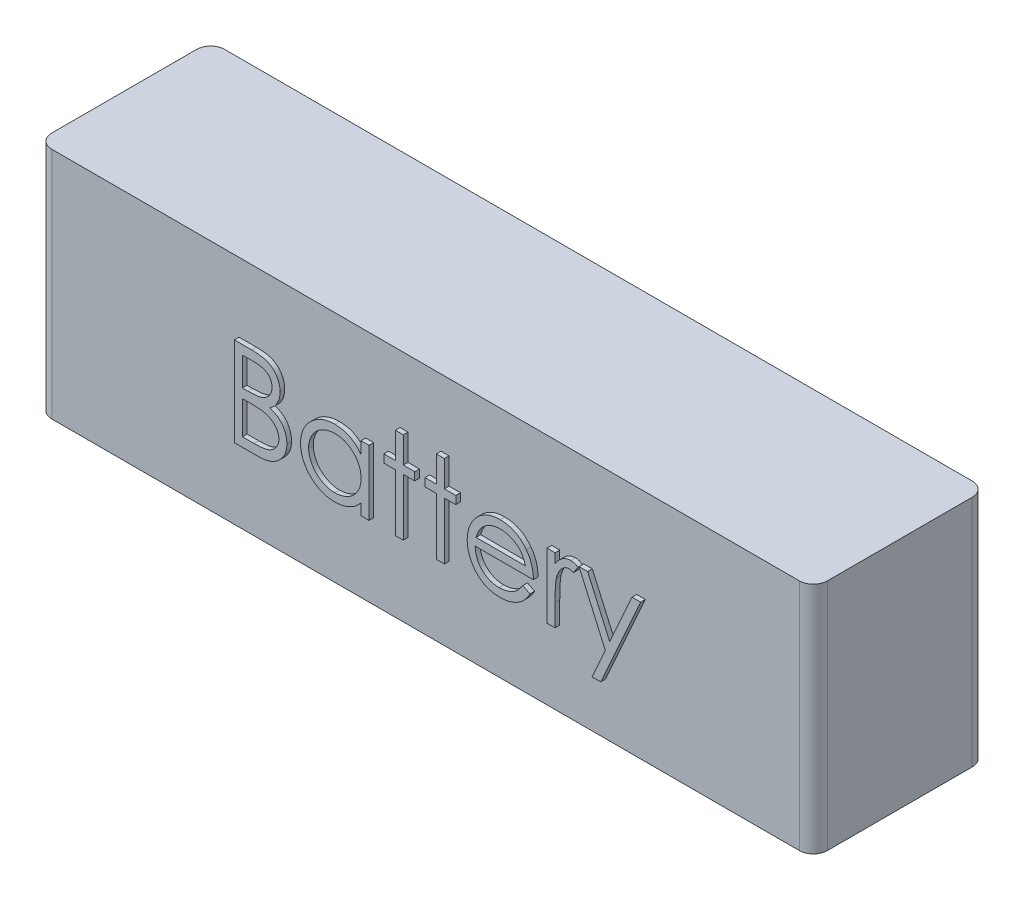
from build123d import *

# Parameters (mm, degrees)
SKETCH1_W           = 166
SKETCH1_H           = 37
BOSS_EXTRUDE1_DEPTH = 50
FILLET2_R           = 3
BOSS_EXTRUDE2_DEPTH = 1


with BuildPart() as part:
    # Sketch1 → Boss-Extrude1 (new body)
    with BuildSketch(Plane(origin=(0, 0, 0), x_dir=(1, 0, 0), z_dir=(0, 1, 0))):
        with Locations((83, 18.5)):
            Rectangle(SKETCH1_W, SKETCH1_H)
    extrude(amount=BOSS_EXTRUDE1_DEPTH)

    # Fillet2
    fillet2_edges = [part.edges().sort_by_distance(p)[0] for p in [
        (0, 25, -37),
        (166, 25, -37),
        (166, 25, 0),
        (0, 25, 0),
    ]]
    fillet(fillet2_edges, radius=FILLET2_R)

    # Sketch2 → Boss-Extrude2 (add)
    # profile 1 of 7: a face of its own
    with BuildSketch(Plane.XY):
        with BuildLine():
            Line((43.08714198, 35.197994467), (46.804028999, 35.197994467))
            add(Edge.make_bspline(
                [(46.804028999, 35.197994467), (46.98597543, 35.197037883), (47.338632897, 35.195183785), (47.851455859, 35.166428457), (48.331781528, 35.127219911), (48.779749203, 35.065007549), (49.195151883, 34.989940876), (49.579241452, 34.899035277), (49.930796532, 34.79003328), (50.35051014, 34.616698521), (50.829049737, 34.359125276), (51.347200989, 33.978514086), (51.790272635, 33.512973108), (52.172286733, 32.987831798), (52.476004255, 32.410149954), (52.695728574, 31.79369637), (52.834836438, 31.146422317), (52.84914263, 30.702050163), (52.856372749, 30.477471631)],
                knots=[0, 0, 0, 0, 1.001505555, 1.941167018, 2.826882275, 3.653841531, 4.429895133, 5.150066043, 5.825578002, 6.45369114, 7.647487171, 8.808567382, 9.977351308, 11.170798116, 12.373658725, 13.556498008, 14.765093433, 16, 16, 16, 16], degree=3))
            add(Edge.make_bspline(
                [(52.856372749, 30.477471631), (52.850422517, 30.267091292), (52.838729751, 29.853674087), (52.726918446, 29.24900472), (52.551872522, 28.673415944), (52.308548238, 28.129008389), (51.992307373, 27.62808258), (51.617521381, 27.166597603), (51.165346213, 26.764092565), (50.82656515, 26.539069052), (50.65447972, 26.424767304)],
                knots=[0, 0, 0, 0, 1.044552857, 2.05264487, 3.044412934, 4.028983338, 5.005914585, 5.980388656, 6.974128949, 8, 8, 8, 8], degree=3))
            add(Edge.make_bspline(
                [(50.65447972, 26.424767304), (50.870890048, 26.341682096), (51.284936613, 26.18271951), (51.854727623, 25.901675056), (52.345645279, 25.595992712), (52.761464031, 25.262172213), (53.117087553, 24.9023514), (53.427618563, 24.511254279), (53.692584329, 24.083779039), (53.919621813, 23.624382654), (54.096780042, 23.137756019), (54.229454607, 22.628463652), (54.305477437, 22.098331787), (54.316295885, 21.737549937), (54.321757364, 21.555416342)],
                knots=[0, 0, 0, 0, 1.27268992, 2.434971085, 3.483601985, 4.442670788, 5.356604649, 6.2567628, 7.179492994, 8.113709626, 9.066344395, 10.018646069, 10.999752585, 12, 12, 12, 12], degree=3))
            add(Edge.make_bspline(
                [(54.321757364, 21.555416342), (54.316440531, 21.369450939), (54.305979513, 21.003558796), (54.228799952, 20.466048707), (54.098121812, 19.952379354), (53.918120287, 19.459228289), (53.683193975, 18.987549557), (53.397291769, 18.536808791), (53.056397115, 18.111534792), (52.675054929, 17.707001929), (52.243642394, 17.343267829), (51.778192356, 17.01933234), (51.272843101, 16.752925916), (50.735894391, 16.529137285), (50.161322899, 16.35819239), (49.551708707, 16.23859881), (48.907577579, 16.158017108), (48.465564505, 16.151392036), (48.238884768, 16.147994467)],
                knots=[0, 0, 0, 0, 0.978564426, 1.925352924, 2.850884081, 3.763762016, 4.682927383, 5.618979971, 6.567305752, 7.547517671, 8.540179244, 9.531824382, 10.526200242, 11.540722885, 12.589160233, 13.674978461, 14.80764778, 16, 16, 16, 16], degree=3))
            Line((48.238884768, 16.147994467), (43.08714198, 16.147994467))
            Line((43.08714198, 16.147994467), (43.08714198, 35.197994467))
        make_face()
        with BuildLine():
            Line((44.796757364, 33.244148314), (44.796757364, 27.138379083))
            Line((44.796757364, 27.138379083), (45.945405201, 27.138379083))
            add(Edge.make_bspline(
                [(45.945405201, 27.138379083), (46.113310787, 27.140555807), (46.437738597, 27.144761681), (46.907565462, 27.156809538), (47.34367449, 27.190544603), (47.745312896, 27.224269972), (48.111848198, 27.279104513), (48.442468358, 27.344375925), (48.74236215, 27.413407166), (49.08819882, 27.530806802), (49.480481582, 27.704312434), (49.898673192, 27.97358057), (50.267342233, 28.294297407), (50.578658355, 28.664362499), (50.833446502, 29.071848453), (51.010414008, 29.510253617), (51.130414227, 29.968651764), (51.141253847, 30.283348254), (51.146757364, 30.443126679)],
                knots=[0, 0, 0, 0, 1.156816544, 2.235205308, 3.236616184, 4.169592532, 5.011045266, 5.787822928, 6.49130361, 7.128639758, 8.301311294, 9.436451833, 10.541879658, 11.654887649, 12.756523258, 13.837046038, 14.901820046, 16, 16, 16, 16], degree=3))
            add(Edge.make_bspline(
                [(51.146757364, 30.443126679), (51.143893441, 30.548858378), (51.138275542, 30.756262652), (51.092265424, 31.058609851), (51.014064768, 31.342965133), (50.913620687, 31.613225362), (50.773256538, 31.860939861), (50.607992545, 32.09467354), (50.408317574, 32.306466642), (50.181038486, 32.504420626), (49.91973441, 32.679922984), (49.624561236, 32.833633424), (49.291525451, 32.957408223), (48.926239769, 33.065808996), (48.523081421, 33.141945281), (48.086702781, 33.205373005), (47.613529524, 33.237664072), (47.286168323, 33.24193869), (47.116949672, 33.244148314)],
                knots=[0, 0, 0, 0, 0.91205012, 1.789085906, 2.630437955, 3.453916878, 4.269457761, 5.079663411, 5.91843418, 6.774407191, 7.675494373, 8.627863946, 9.638891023, 10.736472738, 11.911756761, 13.175263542, 14.539845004, 16, 16, 16, 16], degree=3))
            Line((47.116949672, 33.244148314), (44.796757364, 33.244148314))
        make_face(mode=Mode.SUBTRACT)
        with BuildLine():
            Line((44.796757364, 25.184532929), (44.796757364, 18.101840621))
            Line((44.796757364, 18.101840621), (47.231432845, 18.101840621))
            add(Edge.make_bspline(
                [(47.231432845, 18.101840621), (47.405707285, 18.103929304), (47.741598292, 18.107954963), (48.226563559, 18.121097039), (48.676051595, 18.150990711), (49.088011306, 18.198048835), (49.466891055, 18.249094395), (49.808145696, 18.317735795), (50.114541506, 18.396379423), (50.469820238, 18.517941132), (50.869889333, 18.706789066), (51.301022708, 18.991527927), (51.684342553, 19.330744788), (52.009854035, 19.72334305), (52.27662473, 20.150233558), (52.470692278, 20.60278182), (52.59038537, 21.07351019), (52.604875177, 21.394457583), (52.61214198, 21.555416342)],
                knots=[0, 0, 0, 0, 1.160039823, 2.235823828, 3.228722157, 4.157150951, 4.99529583, 5.772374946, 6.472645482, 7.099169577, 8.269452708, 9.405989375, 10.527446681, 11.663510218, 12.788923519, 13.866172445, 14.929861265, 16, 16, 16, 16], degree=3))
            add(Edge.make_bspline(
                [(52.61214198, 21.555416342), (52.610639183, 21.656072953), (52.607657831, 21.855762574), (52.562696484, 22.149218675), (52.497306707, 22.433476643), (52.412771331, 22.709308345), (52.289656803, 22.971726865), (52.145929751, 23.225922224), (51.977411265, 23.472230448), (51.714825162, 23.78362857), (51.332889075, 24.142405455), (50.79019934, 24.49367386), (50.173130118, 24.776962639), (49.725577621, 24.897246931), (49.494383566, 24.959382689)],
                knots=[0, 0, 0, 0, 0.723448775, 1.435228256, 2.130040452, 2.821711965, 3.505591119, 4.210454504, 4.921174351, 5.648778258, 7.137944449, 8.670945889, 10.280296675, 12, 12, 12, 12], degree=3))
            add(Edge.make_bspline(
                [(49.494383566, 24.959382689), (49.40169663, 24.978188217), (49.200732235, 25.018962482), (48.873030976, 25.062002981), (48.498911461, 25.100348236), (48.0775098, 25.128711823), (47.608292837, 25.15803001), (47.090258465, 25.169431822), (46.525522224, 25.183034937), (46.133678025, 25.184020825), (45.930140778, 25.184532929)],
                knots=[0, 0, 0, 0, 0.634451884, 1.375622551, 2.216452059, 3.157844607, 4.20941857, 5.370758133, 6.634282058, 8, 8, 8, 8], degree=3))
            Line((45.930140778, 25.184532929), (44.796757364, 25.184532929))
        make_face(mode=Mode.SUBTRACT)
    # profile 2 of 7: a face of its own
    with BuildSketch(Plane.XY):
        with BuildLine():
            Line((71.906372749, 30.069148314), (71.906372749, 16.147994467))
            Line((71.906372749, 16.147994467), (70.196757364, 16.147994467))
            Line((70.196757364, 16.147994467), (70.196757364, 18.555957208))
            add(Edge.make_bspline(
                [(70.196757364, 18.555957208), (70.003977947, 18.338027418), (69.627766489, 17.912734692), (68.999436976, 17.357116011), (68.333404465, 16.897856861), (67.63290156, 16.526926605), (66.898560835, 16.248295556), (66.132010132, 16.05025089), (65.332936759, 15.922921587), (64.787277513, 15.910206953), (64.510759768, 15.903763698)],
                knots=[0, 0, 0, 0, 1.074387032, 2.096679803, 3.090159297, 4.057316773, 5.018401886, 5.985159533, 6.978961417, 8, 8, 8, 8], degree=3))
            add(Edge.make_bspline(
                [(64.510759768, 15.903763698), (64.264917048, 15.910438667), (63.780104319, 15.923602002), (63.06693177, 16.02572254), (62.38062967, 16.189719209), (61.720549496, 16.417779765), (61.090962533, 16.720298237), (60.486478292, 17.082472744), (59.910228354, 17.513769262), (59.370996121, 18.006826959), (58.874433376, 18.542376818), (58.438671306, 19.113580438), (58.075343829, 19.717967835), (57.771523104, 20.347886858), (57.537500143, 21.008186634), (57.374357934, 21.696583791), (57.27235636, 22.412264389), (57.259198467, 22.899615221), (57.252526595, 23.146732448)],
                knots=[0, 0, 0, 0, 1.033919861, 2.038935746, 3.024066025, 3.998881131, 4.97069526, 5.957263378, 6.95902576, 7.993208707, 9.027059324, 10.027763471, 11.009749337, 11.988697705, 12.965288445, 13.950418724, 14.960734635, 16, 16, 16, 16], degree=3))
            add(Edge.make_bspline(
                [(57.252526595, 23.146732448), (57.259346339, 23.388742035), (57.272828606, 23.867181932), (57.373266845, 24.570827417), (57.542164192, 25.248562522), (57.779188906, 25.898205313), (58.08312869, 26.520541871), (58.452851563, 27.11601235), (58.888384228, 27.686257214), (59.3905009, 28.217867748), (59.934431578, 28.708925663), (60.516320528, 29.135694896), (61.121692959, 29.50426803), (61.759938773, 29.796296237), (62.421611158, 30.032565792), (63.112600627, 30.196030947), (63.830032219, 30.292354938), (64.317116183, 30.306303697), (64.564185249, 30.313379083)],
                knots=[0, 0, 0, 0, 1.020392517, 2.01726096, 2.990465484, 3.961182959, 4.928053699, 5.906110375, 6.912531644, 7.948652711, 8.985773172, 9.998621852, 10.987621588, 11.969261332, 12.953316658, 13.946091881, 14.958173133, 16, 16, 16, 16], degree=3))
            add(Edge.make_bspline(
                [(64.564185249, 30.313379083), (64.848301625, 30.305553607), (65.405440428, 30.290208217), (66.220388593, 30.162503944), (66.991339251, 29.94675743), (67.724243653, 29.653292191), (68.416469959, 29.263318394), (69.061464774, 28.771393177), (69.665978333, 28.180619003), (70.016391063, 27.726845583), (70.196757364, 27.493276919)],
                knots=[0, 0, 0, 0, 1.038897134, 2.037228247, 3.008116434, 3.962042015, 4.918381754, 5.904844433, 6.921570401, 8, 8, 8, 8], degree=3))
            Line((70.196757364, 27.493276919), (70.196757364, 30.069148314))
            Line((70.196757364, 30.069148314), (71.906372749, 30.069148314))
        make_face()
        with BuildLine():
            add(Edge.make_bspline(
                [(64.587081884, 28.603763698), (64.337176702, 28.594872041), (63.843903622, 28.577321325), (63.119764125, 28.440305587), (62.4268154, 28.212333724), (61.768523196, 27.900556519), (61.155286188, 27.508514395), (60.607224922, 27.034325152), (60.119856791, 26.490926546), (59.709964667, 25.880770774), (59.375824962, 25.226658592), (59.140872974, 24.542902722), (58.985918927, 23.84183563), (58.970088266, 23.366333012), (58.96214198, 23.127651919)],
                knots=[0, 0, 0, 0, 1.031046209, 2.035121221, 3.029706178, 4.034933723, 5.034054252, 6.02443088, 7.017295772, 8.038157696, 9.050218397, 10.03989886, 11.016116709, 12, 12, 12, 12], degree=3))
            add(Edge.make_bspline(
                [(58.96214198, 23.127651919), (58.972292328, 22.890397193), (58.992553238, 22.416817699), (59.138153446, 21.714794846), (59.382428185, 21.030877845), (59.715759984, 20.37087158), (60.133154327, 19.758092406), (60.616962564, 19.204335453), (61.171863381, 18.728142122), (61.78651167, 18.329520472), (62.442963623, 18.007507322), (63.133302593, 17.783448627), (63.844551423, 17.638789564), (64.328161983, 17.62189234), (64.571817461, 17.613379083)],
                knots=[0, 0, 0, 0, 0.979072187, 1.954306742, 2.945804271, 3.96968567, 4.997920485, 5.998718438, 6.996577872, 8.005894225, 9.015743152, 10.005417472, 10.995077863, 12, 12, 12, 12], degree=3))
            add(Edge.make_bspline(
                [(64.571817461, 17.613379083), (64.819176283, 17.622414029), (65.311148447, 17.640383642), (66.037436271, 17.777985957), (66.742258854, 18.00532756), (67.416015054, 18.320464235), (68.043664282, 18.711029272), (68.606988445, 19.168267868), (69.083325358, 19.700052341), (69.487145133, 20.284487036), (69.803785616, 20.925176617), (70.034432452, 21.607352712), (70.170797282, 22.33103907), (70.187984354, 22.825598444), (70.196757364, 23.078042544)],
                knots=[0, 0, 0, 0, 1.01762866, 2.023962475, 3.030623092, 4.058876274, 5.077231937, 6.066672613, 7.034107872, 8.005628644, 8.981990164, 9.965428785, 10.961468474, 12, 12, 12, 12], degree=3))
            add(Edge.make_bspline(
                [(70.196757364, 23.078042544), (70.191534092, 23.270381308), (70.181253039, 23.648964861), (70.10270951, 24.204830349), (69.977769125, 24.736781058), (69.801713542, 25.245376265), (69.570439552, 25.727803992), (69.291505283, 26.187528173), (68.960005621, 26.622157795), (68.581276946, 27.025707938), (68.16672063, 27.393789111), (67.728056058, 27.72234305), (67.260086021, 27.992247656), (66.770680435, 28.215629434), (66.258990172, 28.393388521), (65.720851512, 28.511975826), (65.161984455, 28.593402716), (64.780733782, 28.600273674), (64.587081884, 28.603763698)],
                knots=[0, 0, 0, 0, 1.050140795, 2.067009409, 3.05949893, 4.030605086, 5.00011959, 5.97591094, 6.962425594, 7.979863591, 8.993523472, 9.986985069, 10.967611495, 11.937549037, 12.921786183, 13.919465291, 14.943216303, 16, 16, 16, 16], degree=3))
        make_face(mode=Mode.SUBTRACT)
    # profile 3 of 7: a face of its own
    with BuildSketch(Plane.XY):
        Polygon((77.523680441, 35.686456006), (79.233295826, 35.686456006), (79.233295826, 30.069148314), (81.675603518, 30.069148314), (81.675603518, 28.359532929), (79.233295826, 28.359532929), (79.233295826, 16.147994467), (77.523680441, 16.147994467), (77.523680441, 28.359532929), (75.081372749, 28.359532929), (75.081372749, 30.069148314), (77.523680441, 30.069148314), align=None)
    # profile 4 of 7: a face of its own
    with BuildSketch(Plane.XY):
        Polygon((86.315988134, 35.686456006), (88.025603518, 35.686456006), (88.025603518, 30.069148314), (90.467911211, 30.069148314), (90.467911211, 28.359532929), (88.025603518, 28.359532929), (88.025603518, 16.147994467), (86.315988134, 16.147994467), (86.315988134, 28.359532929), (83.873680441, 28.359532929), (83.873680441, 30.069148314), (86.315988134, 30.069148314), align=None)
    # profile 5 of 7: a face of its own
    with BuildSketch(Plane.XY):
        with BuildLine():
            Line((104.824101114, 20.544148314), (106.342911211, 19.746582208))
            add(Edge.make_bspline(
                [(106.342911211, 19.746582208), (106.221880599, 19.531897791), (105.986402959, 19.114206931), (105.581450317, 18.540356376), (105.156950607, 18.024113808), (104.693741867, 17.579270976), (104.205682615, 17.191459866), (103.690066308, 16.852163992), (103.1442086, 16.563047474), (102.568083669, 16.319465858), (101.956853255, 16.132179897), (101.309036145, 15.999895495), (100.623391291, 15.918125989), (100.153421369, 15.908627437), (99.912772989, 15.903763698)],
                knots=[0, 0, 0, 0, 1.120438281, 2.179929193, 3.190490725, 4.156257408, 5.095198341, 6.022838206, 6.959905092, 7.901321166, 8.864066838, 9.862729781, 10.905609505, 12, 12, 12, 12], degree=3))
            add(Edge.make_bspline(
                [(99.912772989, 15.903763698), (99.645300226, 15.91000761), (99.123538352, 15.922187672), (98.364043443, 16.0271938), (97.648964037, 16.198493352), (96.978340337, 16.437791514), (96.353814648, 16.750360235), (95.77414571, 17.1311397), (95.236285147, 17.578173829), (94.757181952, 18.095334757), (94.325868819, 18.648775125), (93.94527257, 19.225477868), (93.627097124, 19.823991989), (93.36827506, 20.44050727), (93.159242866, 21.071137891), (93.013555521, 21.721621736), (92.929573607, 22.390198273), (92.916704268, 22.8424852), (92.910218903, 23.070410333)],
                knots=[0, 0, 0, 0, 1.145258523, 2.234067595, 3.276747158, 4.290159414, 5.277019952, 6.260822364, 7.254936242, 8.264827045, 9.274100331, 10.257902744, 11.220704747, 12.172965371, 13.118907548, 14.062713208, 15.023725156, 16, 16, 16, 16], degree=3))
            add(Edge.make_bspline(
                [(92.910218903, 23.070410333), (92.915983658, 23.284286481), (92.927408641, 23.708160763), (92.999421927, 24.335534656), (93.127047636, 24.945289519), (93.302178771, 25.537932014), (93.528336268, 26.112469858), (93.805008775, 26.669252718), (94.132627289, 27.207688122), (94.385571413, 27.547339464), (94.512983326, 27.71842716)],
                knots=[0, 0, 0, 0, 1.024358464, 2.0301432, 3.019427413, 4.004406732, 4.986367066, 5.972626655, 6.978780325, 8, 8, 8, 8], degree=3))
            add(Edge.make_bspline(
                [(94.512983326, 27.71842716), (94.685563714, 27.92454201), (95.02525758, 28.330242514), (95.599785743, 28.86330683), (96.221905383, 29.309859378), (96.883820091, 29.680012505), (97.5932229, 29.961264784), (98.340577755, 30.170856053), (99.134394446, 30.288302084), (99.677075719, 30.304891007), (99.954750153, 30.313379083)],
                knots=[0, 0, 0, 0, 1.030682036, 2.02871468, 2.997146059, 3.962720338, 4.930598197, 5.918074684, 6.934738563, 8, 8, 8, 8], degree=3))
            add(Edge.make_bspline(
                [(99.954750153, 30.313379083), (100.240214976, 30.306009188), (100.800231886, 30.291551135), (101.616835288, 30.15751352), (102.389507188, 29.944956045), (103.11793839, 29.644761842), (103.802202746, 29.257450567), (104.43785253, 28.777707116), (105.03575862, 28.220260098), (105.383603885, 27.791563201), (105.560609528, 27.573415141)],
                knots=[0, 0, 0, 0, 1.056321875, 2.072262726, 3.055038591, 4.01806755, 4.982017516, 5.957941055, 6.960871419, 8, 8, 8, 8], degree=3))
            add(Edge.make_bspline(
                [(105.560609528, 27.573415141), (105.681043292, 27.409021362), (105.921109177, 27.081328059), (106.22181125, 26.546996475), (106.4828365, 25.987957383), (106.691477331, 25.395174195), (106.860420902, 24.77567048), (106.982650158, 24.125017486), (107.054330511, 23.443408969), (107.06842042, 22.978988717), (107.075603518, 22.742225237)],
                knots=[0, 0, 0, 0, 0.94817472, 1.890038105, 2.849395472, 3.817997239, 4.812318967, 5.836947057, 6.897266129, 8, 8, 8, 8], degree=3))
            Line((107.075603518, 22.742225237), (94.619834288, 22.742225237))
            add(Edge.make_bspline(
                [(94.619834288, 22.742225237), (94.628214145, 22.558798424), (94.644692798, 22.198096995), (94.721519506, 21.670298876), (94.842616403, 21.167523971), (95.012809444, 20.693543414), (95.218913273, 20.242166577), (95.471384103, 19.816741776), (95.772589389, 19.419206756), (96.108553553, 19.046005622), (96.482516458, 18.713660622), (96.875941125, 18.416198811), (97.294461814, 18.166885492), (97.734778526, 17.964520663), (98.196179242, 17.806099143), (98.678809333, 17.697961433), (99.18171908, 17.625532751), (99.524541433, 17.617479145), (99.699071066, 17.613379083)],
                knots=[0, 0, 0, 0, 1.094153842, 2.151609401, 3.174256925, 4.172055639, 5.149267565, 6.128595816, 7.11444997, 8.118368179, 9.117203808, 10.09244225, 11.054858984, 12.015122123, 12.976791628, 13.957293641, 14.960065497, 16, 16, 16, 16], degree=3))
            add(Edge.make_bspline(
                [(99.699071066, 17.613379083), (99.869710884, 17.616688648), (100.208293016, 17.623255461), (100.712523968, 17.687110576), (101.208583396, 17.790363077), (101.694418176, 17.931278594), (102.160168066, 18.103146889), (102.591490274, 18.3105353), (102.988166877, 18.53995035), (103.358917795, 18.802348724), (103.718532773, 19.123521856), (104.075271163, 19.524310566), (104.457776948, 19.998315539), (104.697206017, 20.355071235), (104.824101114, 20.544148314)],
                knots=[0, 0, 0, 0, 0.99110716, 1.966546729, 2.947904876, 3.932708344, 4.903319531, 5.828989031, 6.710028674, 7.56322171, 8.463672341, 9.504779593, 10.677557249, 12, 12, 12, 12], degree=3))
        make_face()
        with BuildLine():
            add(Edge.make_bspline(
                [(105.365988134, 24.451840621), (105.303413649, 24.678605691), (105.182977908, 25.115055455), (104.931319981, 25.719435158), (104.647902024, 26.256579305), (104.312503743, 26.722377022), (103.932490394, 27.136053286), (103.493550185, 27.497560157), (103.001320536, 27.820960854), (102.458345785, 28.093933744), (101.883352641, 28.326288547), (101.281338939, 28.482090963), (100.667070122, 28.5888229), (100.251593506, 28.598762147), (100.042520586, 28.603763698)],
                knots=[0, 0, 0, 0, 1.154881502, 2.222775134, 3.210006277, 4.132804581, 5.035138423, 5.962687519, 6.919655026, 7.923214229, 8.944639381, 9.960483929, 10.97369054, 12, 12, 12, 12], degree=3))
            add(Edge.make_bspline(
                [(100.042520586, 28.603763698), (99.87189007, 28.600434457), (99.534589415, 28.593853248), (99.037650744, 28.531422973), (98.560422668, 28.428227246), (98.099383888, 28.286903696), (97.660576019, 28.098534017), (97.234973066, 27.877645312), (96.83339691, 27.607997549), (96.58225643, 27.402481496), (96.455381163, 27.298655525)],
                knots=[0, 0, 0, 0, 1.04873581, 2.073130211, 3.073294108, 4.04793562, 5.032784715, 6.005352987, 6.992311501, 8, 8, 8, 8], degree=3))
            add(Edge.make_bspline(
                [(96.455381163, 27.298655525), (96.364522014, 27.216499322), (96.18064524, 27.050235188), (95.93495183, 26.763781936), (95.699708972, 26.45489129), (95.485621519, 26.111745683), (95.28925637, 25.738252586), (95.105505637, 25.337562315), (94.940116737, 24.906634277), (94.847065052, 24.606338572), (94.799191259, 24.451840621)],
                knots=[0, 0, 0, 0, 0.879870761, 1.780643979, 2.707998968, 3.669668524, 4.684282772, 5.740141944, 6.837334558, 8, 8, 8, 8], degree=3))
            Line((94.799191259, 24.451840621), (105.365988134, 24.451840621))
        make_face(mode=Mode.SUBTRACT)
    # profile 6 of 7: a face of its own
    with BuildSketch(Plane.XY):
        with BuildLine():
            Line((110.006372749, 30.069148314), (111.715988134, 30.069148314))
            Line((111.715988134, 30.069148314), (111.715988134, 28.019899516))
            add(Edge.make_bspline(
                [(111.715988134, 28.019899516), (111.842201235, 28.210703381), (112.08358281, 28.575614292), (112.484791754, 29.05822863), (112.8957456, 29.457816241), (113.318411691, 29.776242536), (113.755898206, 30.014711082), (114.198603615, 30.189388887), (114.653492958, 30.292679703), (114.959174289, 30.306470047), (115.112322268, 30.313379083)],
                knots=[0, 0, 0, 0, 1.2804753, 2.448899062, 3.506932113, 4.484331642, 5.4025378, 6.288909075, 7.142734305, 8, 8, 8, 8], degree=3))
            add(Edge.make_bspline(
                [(115.112322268, 30.313379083), (115.231119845, 30.306899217), (115.47555358, 30.293566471), (115.845573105, 30.199890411), (116.226809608, 30.05033146), (116.472513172, 29.909686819), (116.600603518, 29.836365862)],
                knots=[0, 0, 0, 0, 0.901110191, 1.854092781, 2.881294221, 4, 4, 4, 4], degree=3))
            Line((116.600603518, 29.836365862), (115.661841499, 28.355716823))
            add(Edge.make_bspline(
                [(115.661841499, 28.355716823), (115.579605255, 28.392403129), (115.423505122, 28.46204076), (115.195152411, 28.544456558), (114.984615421, 28.592984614), (114.850484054, 28.600336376), (114.787953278, 28.603763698)],
                knots=[0, 0, 0, 0, 1.180555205, 2.24091978, 3.179933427, 4, 4, 4, 4], degree=3))
            add(Edge.make_bspline(
                [(114.787953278, 28.603763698), (114.650762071, 28.594619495), (114.370931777, 28.575967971), (113.96008043, 28.429343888), (113.561406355, 28.192442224), (113.244786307, 27.929709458), (112.999627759, 27.676356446), (112.824693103, 27.455112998), (112.664222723, 27.207035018), (112.510896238, 26.936363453), (112.371198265, 26.63847672), (112.240816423, 26.316350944), (112.122930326, 25.969613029), (112.055709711, 25.728045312), (112.021276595, 25.604304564)],
                knots=[0, 0, 0, 0, 1.125678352, 2.296057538, 3.5422874, 4.923748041, 5.663163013, 6.437101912, 7.23742474, 8.08941207, 8.991984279, 9.93940061, 10.944477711, 12, 12, 12, 12], degree=3))
            add(Edge.make_bspline(
                [(112.021276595, 25.604304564), (111.995518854, 25.493938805), (111.938467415, 25.249487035), (111.882996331, 24.839375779), (111.828189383, 24.354832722), (111.789563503, 23.794509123), (111.753760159, 23.15980425), (111.733566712, 22.449751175), (111.716676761, 21.663621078), (111.71622464, 21.114032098), (111.715988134, 20.826540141)],
                knots=[0, 0, 0, 0, 0.566838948, 1.255505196, 2.06880316, 3.007127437, 4.065329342, 5.249902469, 6.561414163, 8, 8, 8, 8], degree=3))
            Line((111.715988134, 20.826540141), (111.715988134, 16.147994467))
            Line((111.715988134, 16.147994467), (110.006372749, 16.147994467))
            Line((110.006372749, 16.147994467), (110.006372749, 30.069148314))
        make_face()
    # profile 7 of 7: a face of its own
    with BuildSketch(Plane.XY):
        Polygon((116.844834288, 30.069148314), (118.688013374, 30.069148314), (123.400903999, 19.406948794), (128.186300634, 30.069148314), (130.033295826, 30.069148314), (121.485218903, 11.019148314), (119.638223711, 11.019148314), (122.473590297, 17.334803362), align=None)
    extrude(amount=BOSS_EXTRUDE2_DEPTH)


solid = part.part
